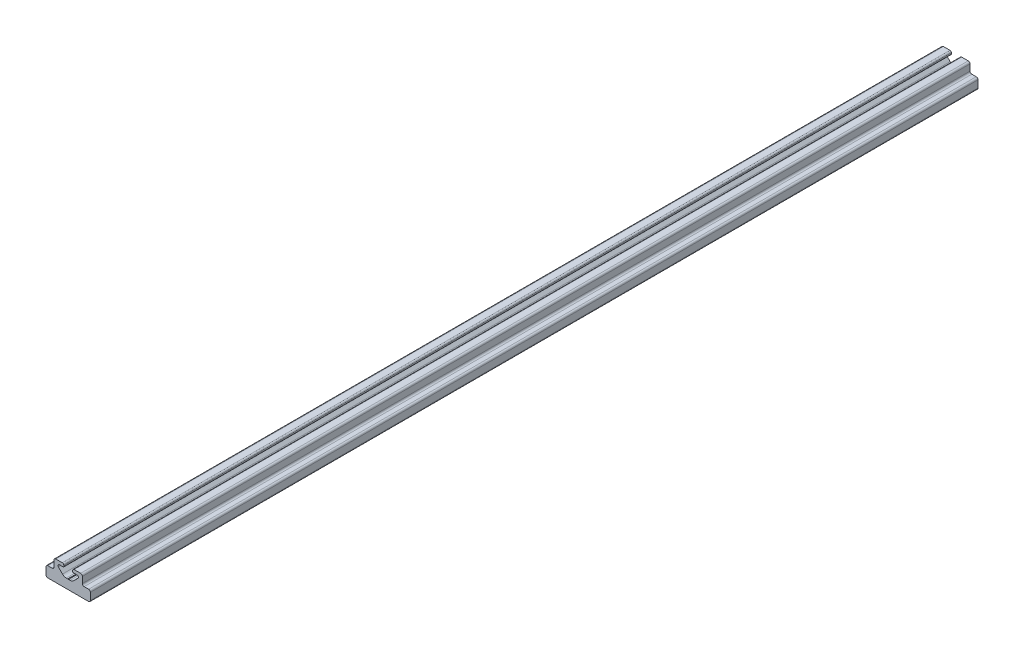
ISO-10303-21;
HEADER;
FILE_DESCRIPTION(('STEP AP214'),'2;1');
FILE_NAME('part.step','',(''),(''),'','','');
FILE_SCHEMA(('AUTOMOTIVE_DESIGN { 1 0 10303 214 1 1 1 1 }'));
ENDSEC;
DATA;
#1=APPLICATION_CONTEXT('core data for automotive mechanical design processes');
#2=APPLICATION_PROTOCOL_DEFINITION('international standard','automotive_design',2000,#1);
#3=PRODUCT_CONTEXT('',#1,'mechanical');
#4=PRODUCT('Part','Part','',(#3));
#5=PRODUCT_RELATED_PRODUCT_CATEGORY('part','',(#4));
#6=PRODUCT_DEFINITION_FORMATION('','',#4);
#7=PRODUCT_DEFINITION_CONTEXT('part definition',#1,'design');
#8=PRODUCT_DEFINITION('design','',#6,#7);
#9=PRODUCT_DEFINITION_SHAPE('','',#8);
#10=(LENGTH_UNIT() NAMED_UNIT(*) SI_UNIT(.MILLI.,.METRE.));
#11=(NAMED_UNIT(*) PLANE_ANGLE_UNIT() SI_UNIT($,.RADIAN.));
#12=(NAMED_UNIT(*) SI_UNIT($,.STERADIAN.) SOLID_ANGLE_UNIT());
#13=UNCERTAINTY_MEASURE_WITH_UNIT(LENGTH_MEASURE(1.E-05),#10,'distance_accuracy_value','');
#14=(GEOMETRIC_REPRESENTATION_CONTEXT(3) GLOBAL_UNCERTAINTY_ASSIGNED_CONTEXT((#13)) GLOBAL_UNIT_ASSIGNED_CONTEXT((#10,
#11,#12)) REPRESENTATION_CONTEXT('',''));
#15=CARTESIAN_POINT('',(0.,0.,0.));
#16=DIRECTION('',(0.,0.,1.));
#17=DIRECTION('',(1.,0.,0.));
#18=AXIS2_PLACEMENT_3D('',#15,#16,#17);
#19=CARTESIAN_POINT('',(0.,4.900028,0.));
#20=DIRECTION('',(0.707106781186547,-0.707106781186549,0.));
#21=DIRECTION('',(0.707106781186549,0.707106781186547,0.));
#22=AXIS2_PLACEMENT_3D('',#19,#20,#21);
#23=PLANE('',#22);
#24=DIRECTION('',(0.,0.,1.));
#25=VECTOR('',#24,1.);
#26=CARTESIAN_POINT('',(0.,4.900028,250.));
#27=LINE('',#26,#25);
#28=CARTESIAN_POINT('',(0.,4.900028,0.));
#29=VERTEX_POINT('',#28);
#30=CARTESIAN_POINT('',(0.,4.900028,500.));
#31=VERTEX_POINT('',#30);
#32=EDGE_CURVE('E384',#29,#31,#27,.T.);
#33=ORIENTED_EDGE('',*,*,#32,.T.);
#34=DIRECTION('',(-0.707106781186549,-0.707106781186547,0.));
#35=VECTOR('',#34,1.);
#36=CARTESIAN_POINT('',(0.125,5.025028,500.));
#37=LINE('',#36,#35);
#38=CARTESIAN_POINT('',(0.25,5.150028,500.));
#39=VERTEX_POINT('',#38);
#40=EDGE_CURVE('E230',#39,#31,#37,.T.);
#41=ORIENTED_EDGE('',*,*,#40,.F.);
#42=DIRECTION('',(0.,0.,-1.));
#43=VECTOR('',#42,1.);
#44=CARTESIAN_POINT('',(0.25,5.150028,250.));
#45=LINE('',#44,#43);
#46=CARTESIAN_POINT('',(0.25,5.150028,0.));
#47=VERTEX_POINT('',#46);
#48=EDGE_CURVE('E362',#39,#47,#45,.T.);
#49=ORIENTED_EDGE('',*,*,#48,.T.);
#50=DIRECTION('',(0.707106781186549,0.707106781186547,0.));
#51=VECTOR('',#50,1.);
#52=CARTESIAN_POINT('',(0.125,5.025028,0.));
#53=LINE('',#52,#51);
#54=EDGE_CURVE('E386',#29,#47,#53,.T.);
#55=ORIENTED_EDGE('',*,*,#54,.F.);
#56=EDGE_LOOP('',(#33,#41,#49,#55));
#57=FACE_BOUND('',#56,.T.);
#58=ADVANCED_FACE('F14',(#57),#23,.F.);
#59=CARTESIAN_POINT('',(-0.25,5.150028,0.));
#60=DIRECTION('',(-0.707106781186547,-0.707106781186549,0.));
#61=DIRECTION('',(0.707106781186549,-0.707106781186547,0.));
#62=AXIS2_PLACEMENT_3D('',#59,#60,#61);
#63=PLANE('',#62);
#64=DIRECTION('',(0.,0.,1.));
#65=VECTOR('',#64,1.);
#66=CARTESIAN_POINT('',(-0.25,5.150028,250.));
#67=LINE('',#66,#65);
#68=CARTESIAN_POINT('',(-0.25,5.150028,0.));
#69=VERTEX_POINT('',#68);
#70=CARTESIAN_POINT('',(-0.25,5.150028,500.));
#71=VERTEX_POINT('',#70);
#72=EDGE_CURVE('E356',#69,#71,#67,.T.);
#73=ORIENTED_EDGE('',*,*,#72,.T.);
#74=DIRECTION('',(-0.707106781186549,0.707106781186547,0.));
#75=VECTOR('',#74,1.);
#76=CARTESIAN_POINT('',(-0.125,5.025028,500.));
#77=LINE('',#76,#75);
#78=EDGE_CURVE('E381',#31,#71,#77,.T.);
#79=ORIENTED_EDGE('',*,*,#78,.F.);
#80=ORIENTED_EDGE('',*,*,#32,.F.);
#81=DIRECTION('',(0.707106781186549,-0.707106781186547,0.));
#82=VECTOR('',#81,1.);
#83=CARTESIAN_POINT('',(-0.125,5.025028,0.));
#84=LINE('',#83,#82);
#85=EDGE_CURVE('E374',#69,#29,#84,.T.);
#86=ORIENTED_EDGE('',*,*,#85,.F.);
#87=EDGE_LOOP('',(#73,#79,#80,#86));
#88=FACE_BOUND('',#87,.T.);
#89=ADVANCED_FACE('F622',(#88),#63,.F.);
#90=CARTESIAN_POINT('',(2.5,10.,0.));
#91=DIRECTION('',(-1.,0.,0.));
#92=DIRECTION('',(0.,0.,1.));
#93=AXIS2_PLACEMENT_3D('',#90,#91,#92);
#94=PLANE('',#93);
#95=DIRECTION('',(0.,1.,0.));
#96=VECTOR('',#95,1.);
#97=CARTESIAN_POINT('',(2.5,10.350014,500.));
#98=LINE('',#97,#96);
#99=CARTESIAN_POINT('',(2.5,9.99999999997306,500.));
#100=VERTEX_POINT('',#99);
#101=CARTESIAN_POINT('',(2.5,10.700028,500.));
#102=VERTEX_POINT('',#101);
#103=EDGE_CURVE('E221',#100,#102,#98,.T.);
#104=ORIENTED_EDGE('',*,*,#103,.T.);
#105=DIRECTION('',(0.,0.,1.));
#106=VECTOR('',#105,1.);
#107=CARTESIAN_POINT('',(2.5,10.700028,250.));
#108=LINE('',#107,#106);
#109=CARTESIAN_POINT('',(2.5,10.700028,0.));
#110=VERTEX_POINT('',#109);
#111=EDGE_CURVE('E367',#102,#110,#108,.F.);
#112=ORIENTED_EDGE('',*,*,#111,.T.);
#113=DIRECTION('',(0.,-1.,0.));
#114=VECTOR('',#113,1.);
#115=CARTESIAN_POINT('',(2.5,10.350014,0.));
#116=LINE('',#115,#114);
#117=CARTESIAN_POINT('',(2.5,9.99999999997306,0.));
#118=VERTEX_POINT('',#117);
#119=EDGE_CURVE('E372',#110,#118,#116,.T.);
#120=ORIENTED_EDGE('',*,*,#119,.T.);
#121=DIRECTION('',(0.,0.,-1.));
#122=VECTOR('',#121,1.);
#123=CARTESIAN_POINT('',(2.5,9.99999999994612,250.));
#124=LINE('',#123,#122);
#125=EDGE_CURVE('E376',#118,#100,#124,.F.);
#126=ORIENTED_EDGE('',*,*,#125,.T.);
#127=EDGE_LOOP('',(#104,#112,#120,#126));
#128=FACE_BOUND('',#127,.T.);
#129=ADVANCED_FACE('F547',(#128),#94,.T.);
#130=CARTESIAN_POINT('',(2.8,10.,500.));
#131=DIRECTION('',(0.,0.,-1.));
#132=DIRECTION('',(-1.,0.,0.));
#133=AXIS2_PLACEMENT_3D('',#130,#131,#132);
#134=CYLINDRICAL_SURFACE('',#133,0.3);
#135=DIRECTION('',(0.,0.,-1.));
#136=VECTOR('',#135,1.);
#137=CARTESIAN_POINT('',(2.8,9.7,250.));
#138=LINE('',#137,#136);
#139=CARTESIAN_POINT('',(2.8,9.6999999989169,500.));
#140=VERTEX_POINT('',#139);
#141=CARTESIAN_POINT('',(2.8,9.6999999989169,0.));
#142=VERTEX_POINT('',#141);
#143=EDGE_CURVE('E345',#140,#142,#138,.T.);
#144=ORIENTED_EDGE('',*,*,#143,.F.);
#145=CARTESIAN_POINT('',(2.8,10.,500.));
#146=DIRECTION('',(0.,0.,-1.));
#147=DIRECTION('',(-1.,0.,0.));
#148=AXIS2_PLACEMENT_3D('',#145,#146,#147);
#149=CIRCLE('',#148,0.3);
#150=EDGE_CURVE('E18',#100,#140,#149,.F.);
#151=ORIENTED_EDGE('',*,*,#150,.F.);
#152=ORIENTED_EDGE('',*,*,#125,.F.);
#153=CARTESIAN_POINT('',(2.8,10.,0.));
#154=DIRECTION('',(0.,0.,-1.));
#155=DIRECTION('',(-1.,0.,0.));
#156=AXIS2_PLACEMENT_3D('',#153,#154,#155);
#157=CIRCLE('',#156,0.3);
#158=EDGE_CURVE('E366',#142,#118,#157,.T.);
#159=ORIENTED_EDGE('',*,*,#158,.F.);
#160=EDGE_LOOP('',(#144,#151,#152,#159));
#161=FACE_BOUND('',#160,.T.);
#162=ADVANCED_FACE('F467',(#161),#134,.T.);
#163=CARTESIAN_POINT('',(0.25,5.150028,0.));
#164=DIRECTION('',(0.,-1.,0.));
#165=DIRECTION('',(1.,0.,0.));
#166=AXIS2_PLACEMENT_3D('',#163,#164,#165);
#167=PLANE('',#166);
#168=ORIENTED_EDGE('',*,*,#48,.F.);
#169=DIRECTION('',(-1.,0.,0.));
#170=VECTOR('',#169,1.);
#171=CARTESIAN_POINT('',(0.6693790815,5.150028,500.));
#172=LINE('',#171,#170);
#173=CARTESIAN_POINT('',(1.08875816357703,5.150028,500.));
#174=VERTEX_POINT('',#173);
#175=EDGE_CURVE('E363',#174,#39,#172,.T.);
#176=ORIENTED_EDGE('',*,*,#175,.F.);
#177=DIRECTION('',(0.,0.,-1.));
#178=VECTOR('',#177,1.);
#179=CARTESIAN_POINT('',(1.08875816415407,5.150028,250.));
#180=LINE('',#179,#178);
#181=CARTESIAN_POINT('',(1.08875816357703,5.150028,0.));
#182=VERTEX_POINT('',#181);
#183=EDGE_CURVE('E337',#182,#174,#180,.F.);
#184=ORIENTED_EDGE('',*,*,#183,.F.);
#185=DIRECTION('',(1.,0.,0.));
#186=VECTOR('',#185,1.);
#187=CARTESIAN_POINT('',(0.6693790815,5.150028,0.));
#188=LINE('',#187,#186);
#189=EDGE_CURVE('E360',#47,#182,#188,.T.);
#190=ORIENTED_EDGE('',*,*,#189,.F.);
#191=EDGE_LOOP('',(#168,#176,#184,#190));
#192=FACE_BOUND('',#191,.T.);
#193=ADVANCED_FACE('F628',(#192),#167,.F.);
#194=CARTESIAN_POINT('',(-1.088758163,5.150028,0.));
#195=DIRECTION('',(0.,-1.,0.));
#196=DIRECTION('',(1.,0.,0.));
#197=AXIS2_PLACEMENT_3D('',#194,#195,#196);
#198=PLANE('',#197);
#199=DIRECTION('',(0.,0.,1.));
#200=VECTOR('',#199,1.);
#201=CARTESIAN_POINT('',(-1.08875816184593,5.150028,250.));
#202=LINE('',#201,#200);
#203=CARTESIAN_POINT('',(-1.08875816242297,5.150028,500.));
#204=VERTEX_POINT('',#203);
#205=CARTESIAN_POINT('',(-1.08875816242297,5.150028,0.));
#206=VERTEX_POINT('',#205);
#207=EDGE_CURVE('E326',#204,#206,#202,.F.);
#208=ORIENTED_EDGE('',*,*,#207,.F.);
#209=DIRECTION('',(-1.,0.,0.));
#210=VECTOR('',#209,1.);
#211=CARTESIAN_POINT('',(-0.6693790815,5.150028,500.));
#212=LINE('',#211,#210);
#213=EDGE_CURVE('E353',#71,#204,#212,.T.);
#214=ORIENTED_EDGE('',*,*,#213,.F.);
#215=ORIENTED_EDGE('',*,*,#72,.F.);
#216=DIRECTION('',(1.,0.,0.));
#217=VECTOR('',#216,1.);
#218=CARTESIAN_POINT('',(-0.6693790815,5.150028,0.));
#219=LINE('',#218,#217);
#220=EDGE_CURVE('E355',#206,#69,#219,.T.);
#221=ORIENTED_EDGE('',*,*,#220,.F.);
#222=EDGE_LOOP('',(#208,#214,#215,#221));
#223=FACE_BOUND('',#222,.T.);
#224=ADVANCED_FACE('F631',(#223),#198,.F.);
#225=CARTESIAN_POINT('',(-3.3,10.700028,500.));
#226=DIRECTION('',(0.,0.,-1.));
#227=DIRECTION('',(-1.,0.,0.));
#228=AXIS2_PLACEMENT_3D('',#225,#226,#227);
#229=CYLINDRICAL_SURFACE('',#228,0.8);
#230=DIRECTION('',(0.,0.,-1.));
#231=VECTOR('',#230,1.);
#232=CARTESIAN_POINT('',(-3.3,11.500028,250.));
#233=LINE('',#232,#231);
#234=CARTESIAN_POINT('',(-3.3,11.500028,500.));
#235=VERTEX_POINT('',#234);
#236=CARTESIAN_POINT('',(-3.3,11.500028,0.));
#237=VERTEX_POINT('',#236);
#238=EDGE_CURVE('E323',#235,#237,#233,.T.);
#239=ORIENTED_EDGE('',*,*,#238,.F.);
#240=CARTESIAN_POINT('',(-3.3,10.700028,500.));
#241=DIRECTION('',(0.,0.,-1.));
#242=DIRECTION('',(-1.,0.,0.));
#243=AXIS2_PLACEMENT_3D('',#240,#241,#242);
#244=CIRCLE('',#243,0.8);
#245=CARTESIAN_POINT('',(-2.5,10.700028,500.));
#246=VERTEX_POINT('',#245);
#247=EDGE_CURVE('E359',#246,#235,#244,.F.);
#248=ORIENTED_EDGE('',*,*,#247,.F.);
#249=DIRECTION('',(0.,0.,-1.));
#250=VECTOR('',#249,1.);
#251=CARTESIAN_POINT('',(-2.5,10.700028,250.));
#252=LINE('',#251,#250);
#253=CARTESIAN_POINT('',(-2.5,10.700028,0.));
#254=VERTEX_POINT('',#253);
#255=EDGE_CURVE('E349',#246,#254,#252,.T.);
#256=ORIENTED_EDGE('',*,*,#255,.T.);
#257=CARTESIAN_POINT('',(-3.3,10.700028,0.));
#258=DIRECTION('',(0.,0.,-1.));
#259=DIRECTION('',(-1.,0.,0.));
#260=AXIS2_PLACEMENT_3D('',#257,#258,#259);
#261=CIRCLE('',#260,0.8);
#262=EDGE_CURVE('E457',#237,#254,#261,.T.);
#263=ORIENTED_EDGE('',*,*,#262,.F.);
#264=EDGE_LOOP('',(#239,#248,#256,#263));
#265=FACE_BOUND('',#264,.T.);
#266=ADVANCED_FACE('F635',(#265),#229,.T.);
#267=CARTESIAN_POINT('',(-7.,10.500028,500.));
#268=DIRECTION('',(0.,0.,-1.));
#269=DIRECTION('',(-1.,0.,0.));
#270=AXIS2_PLACEMENT_3D('',#267,#268,#269);
#271=CYLINDRICAL_SURFACE('',#270,1.);
#272=DIRECTION('',(0.,0.,-1.));
#273=VECTOR('',#272,1.);
#274=CARTESIAN_POINT('',(-8.,10.500028,250.));
#275=LINE('',#274,#273);
#276=CARTESIAN_POINT('',(-8.,10.500028,500.));
#277=VERTEX_POINT('',#276);
#278=CARTESIAN_POINT('',(-8.,10.500028,0.));
#279=VERTEX_POINT('',#278);
#280=EDGE_CURVE('E316',#277,#279,#275,.T.);
#281=ORIENTED_EDGE('',*,*,#280,.F.);
#282=CARTESIAN_POINT('',(-7.,10.500028,500.));
#283=DIRECTION('',(0.,0.,-1.));
#284=DIRECTION('',(-1.,0.,0.));
#285=AXIS2_PLACEMENT_3D('',#282,#283,#284);
#286=CIRCLE('',#285,1.);
#287=CARTESIAN_POINT('',(-7.,11.500028,500.));
#288=VERTEX_POINT('',#287);
#289=EDGE_CURVE('E455',#288,#277,#286,.F.);
#290=ORIENTED_EDGE('',*,*,#289,.F.);
#291=DIRECTION('',(0.,0.,1.));
#292=VECTOR('',#291,1.);
#293=CARTESIAN_POINT('',(-7.,11.500028,250.));
#294=LINE('',#293,#292);
#295=CARTESIAN_POINT('',(-7.,11.500028,0.));
#296=VERTEX_POINT('',#295);
#297=EDGE_CURVE('E322',#296,#288,#294,.T.);
#298=ORIENTED_EDGE('',*,*,#297,.F.);
#299=CARTESIAN_POINT('',(-7.,10.500028,0.));
#300=DIRECTION('',(0.,0.,-1.));
#301=DIRECTION('',(-1.,0.,0.));
#302=AXIS2_PLACEMENT_3D('',#299,#300,#301);
#303=CIRCLE('',#302,1.);
#304=EDGE_CURVE('E453',#279,#296,#303,.T.);
#305=ORIENTED_EDGE('',*,*,#304,.F.);
#306=EDGE_LOOP('',(#281,#290,#298,#305));
#307=FACE_BOUND('',#306,.T.);
#308=ADVANCED_FACE('F509',(#307),#271,.T.);
#309=CARTESIAN_POINT('',(-9.,7.,500.));
#310=DIRECTION('',(0.,0.,-1.));
#311=DIRECTION('',(-1.,0.,0.));
#312=AXIS2_PLACEMENT_3D('',#309,#310,#311);
#313=CYLINDRICAL_SURFACE('',#312,1.);
#314=CARTESIAN_POINT('',(-9.,7.,500.));
#315=DIRECTION('',(0.,0.,-1.));
#316=DIRECTION('',(-1.,0.,0.));
#317=AXIS2_PLACEMENT_3D('',#314,#315,#316);
#318=CIRCLE('',#317,1.);
#319=CARTESIAN_POINT('',(-9.,5.99999999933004,500.));
#320=VERTEX_POINT('',#319);
#321=CARTESIAN_POINT('',(-8.,7.,500.));
#322=VERTEX_POINT('',#321);
#323=EDGE_CURVE('E449',#320,#322,#318,.F.);
#324=ORIENTED_EDGE('',*,*,#323,.T.);
#325=DIRECTION('',(0.,0.,1.));
#326=VECTOR('',#325,1.);
#327=CARTESIAN_POINT('',(-8.,7.,250.));
#328=LINE('',#327,#326);
#329=CARTESIAN_POINT('',(-8.,7.,0.));
#330=VERTEX_POINT('',#329);
#331=EDGE_CURVE('E319',#330,#322,#328,.T.);
#332=ORIENTED_EDGE('',*,*,#331,.F.);
#333=CARTESIAN_POINT('',(-9.,7.,0.));
#334=DIRECTION('',(0.,0.,-1.));
#335=DIRECTION('',(-1.,0.,0.));
#336=AXIS2_PLACEMENT_3D('',#333,#334,#335);
#337=CIRCLE('',#336,1.);
#338=CARTESIAN_POINT('',(-9.,5.99999999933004,0.));
#339=VERTEX_POINT('',#338);
#340=EDGE_CURVE('E451',#330,#339,#337,.T.);
#341=ORIENTED_EDGE('',*,*,#340,.T.);
#342=DIRECTION('',(0.,0.,-1.));
#343=VECTOR('',#342,1.);
#344=CARTESIAN_POINT('',(-9.,6.,250.));
#345=LINE('',#344,#343);
#346=EDGE_CURVE('E310',#320,#339,#345,.T.);
#347=ORIENTED_EDGE('',*,*,#346,.F.);
#348=EDGE_LOOP('',(#324,#332,#341,#347));
#349=FACE_BOUND('',#348,.T.);
#350=ADVANCED_FACE('F598',(#349),#313,.F.);
#351=CARTESIAN_POINT('',(-11.5,5.,500.));
#352=DIRECTION('',(0.,0.,-1.));
#353=DIRECTION('',(-1.,0.,0.));
#354=AXIS2_PLACEMENT_3D('',#351,#352,#353);
#355=CYLINDRICAL_SURFACE('',#354,1.);
#356=DIRECTION('',(0.,0.,-1.));
#357=VECTOR('',#356,1.);
#358=CARTESIAN_POINT('',(-12.5,5.,250.));
#359=LINE('',#358,#357);
#360=CARTESIAN_POINT('',(-12.5,5.,500.));
#361=VERTEX_POINT('',#360);
#362=CARTESIAN_POINT('',(-12.5,5.,0.));
#363=VERTEX_POINT('',#362);
#364=EDGE_CURVE('E302',#361,#363,#359,.T.);
#365=ORIENTED_EDGE('',*,*,#364,.F.);
#366=CARTESIAN_POINT('',(-11.5,5.,500.));
#367=DIRECTION('',(0.,0.,-1.));
#368=DIRECTION('',(-1.,0.,0.));
#369=AXIS2_PLACEMENT_3D('',#366,#367,#368);
#370=CIRCLE('',#369,1.);
#371=CARTESIAN_POINT('',(-11.5,5.99999999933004,500.));
#372=VERTEX_POINT('',#371);
#373=EDGE_CURVE('E447',#372,#361,#370,.F.);
#374=ORIENTED_EDGE('',*,*,#373,.F.);
#375=DIRECTION('',(0.,0.,1.));
#376=VECTOR('',#375,1.);
#377=CARTESIAN_POINT('',(-11.5,6.,250.));
#378=LINE('',#377,#376);
#379=CARTESIAN_POINT('',(-11.5,5.99999999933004,0.));
#380=VERTEX_POINT('',#379);
#381=EDGE_CURVE('E313',#380,#372,#378,.T.);
#382=ORIENTED_EDGE('',*,*,#381,.F.);
#383=CARTESIAN_POINT('',(-11.5,5.,0.));
#384=DIRECTION('',(0.,0.,-1.));
#385=DIRECTION('',(-1.,0.,0.));
#386=AXIS2_PLACEMENT_3D('',#383,#384,#385);
#387=CIRCLE('',#386,1.);
#388=EDGE_CURVE('E445',#363,#380,#387,.T.);
#389=ORIENTED_EDGE('',*,*,#388,.F.);
#390=EDGE_LOOP('',(#365,#374,#382,#389));
#391=FACE_BOUND('',#390,.T.);
#392=ADVANCED_FACE('F591',(#391),#355,.T.);
#393=CARTESIAN_POINT('',(-11.5,1.,500.));
#394=DIRECTION('',(0.,0.,-1.));
#395=DIRECTION('',(-1.,0.,0.));
#396=AXIS2_PLACEMENT_3D('',#393,#394,#395);
#397=CYLINDRICAL_SURFACE('',#396,1.);
#398=DIRECTION('',(0.,0.,1.));
#399=VECTOR('',#398,1.);
#400=CARTESIAN_POINT('',(-11.5,0.,250.));
#401=LINE('',#400,#399);
#402=CARTESIAN_POINT('',(-11.5,0.,0.));
#403=VERTEX_POINT('',#402);
#404=CARTESIAN_POINT('',(-11.5,0.,500.));
#405=VERTEX_POINT('',#404);
#406=EDGE_CURVE('E299',#403,#405,#401,.T.);
#407=ORIENTED_EDGE('',*,*,#406,.T.);
#408=CARTESIAN_POINT('',(-11.5,1.,500.));
#409=DIRECTION('',(0.,0.,-1.));
#410=DIRECTION('',(-1.,0.,0.));
#411=AXIS2_PLACEMENT_3D('',#408,#409,#410);
#412=CIRCLE('',#411,1.);
#413=CARTESIAN_POINT('',(-12.5,1.,500.));
#414=VERTEX_POINT('',#413);
#415=EDGE_CURVE('E443',#414,#405,#412,.F.);
#416=ORIENTED_EDGE('',*,*,#415,.F.);
#417=DIRECTION('',(0.,0.,1.));
#418=VECTOR('',#417,1.);
#419=CARTESIAN_POINT('',(-12.5,1.,250.));
#420=LINE('',#419,#418);
#421=CARTESIAN_POINT('',(-12.5,1.,0.));
#422=VERTEX_POINT('',#421);
#423=EDGE_CURVE('E307',#422,#414,#420,.T.);
#424=ORIENTED_EDGE('',*,*,#423,.F.);
#425=CARTESIAN_POINT('',(-11.5,1.,0.));
#426=DIRECTION('',(0.,0.,-1.));
#427=DIRECTION('',(-1.,0.,0.));
#428=AXIS2_PLACEMENT_3D('',#425,#426,#427);
#429=CIRCLE('',#428,1.);
#430=EDGE_CURVE('E441',#403,#422,#429,.T.);
#431=ORIENTED_EDGE('',*,*,#430,.F.);
#432=EDGE_LOOP('',(#407,#416,#424,#431));
#433=FACE_BOUND('',#432,.T.);
#434=ADVANCED_FACE('F581',(#433),#397,.T.);
#435=CARTESIAN_POINT('',(11.5,1.,500.));
#436=DIRECTION('',(0.,0.,-1.));
#437=DIRECTION('',(-1.,0.,0.));
#438=AXIS2_PLACEMENT_3D('',#435,#436,#437);
#439=CYLINDRICAL_SURFACE('',#438,1.);
#440=DIRECTION('',(0.,0.,1.));
#441=VECTOR('',#440,1.);
#442=CARTESIAN_POINT('',(12.5,1.,250.));
#443=LINE('',#442,#441);
#444=CARTESIAN_POINT('',(12.5,1.,0.));
#445=VERTEX_POINT('',#444);
#446=CARTESIAN_POINT('',(12.5,1.,500.));
#447=VERTEX_POINT('',#446);
#448=EDGE_CURVE('E293',#445,#447,#443,.T.);
#449=ORIENTED_EDGE('',*,*,#448,.T.);
#450=CARTESIAN_POINT('',(11.5,1.,500.));
#451=DIRECTION('',(0.,0.,-1.));
#452=DIRECTION('',(-1.,0.,0.));
#453=AXIS2_PLACEMENT_3D('',#450,#451,#452);
#454=CIRCLE('',#453,1.);
#455=CARTESIAN_POINT('',(11.5,0.,500.));
#456=VERTEX_POINT('',#455);
#457=EDGE_CURVE('E439',#456,#447,#454,.F.);
#458=ORIENTED_EDGE('',*,*,#457,.F.);
#459=DIRECTION('',(0.,0.,-1.));
#460=VECTOR('',#459,1.);
#461=CARTESIAN_POINT('',(11.5,0.,250.));
#462=LINE('',#461,#460);
#463=CARTESIAN_POINT('',(11.5,0.,0.));
#464=VERTEX_POINT('',#463);
#465=EDGE_CURVE('E296',#456,#464,#462,.T.);
#466=ORIENTED_EDGE('',*,*,#465,.T.);
#467=CARTESIAN_POINT('',(11.5,1.,0.));
#468=DIRECTION('',(0.,0.,-1.));
#469=DIRECTION('',(-1.,0.,0.));
#470=AXIS2_PLACEMENT_3D('',#467,#468,#469);
#471=CIRCLE('',#470,1.);
#472=EDGE_CURVE('E437',#445,#464,#471,.T.);
#473=ORIENTED_EDGE('',*,*,#472,.F.);
#474=EDGE_LOOP('',(#449,#458,#466,#473));
#475=FACE_BOUND('',#474,.T.);
#476=ADVANCED_FACE('F575',(#475),#439,.T.);
#477=CARTESIAN_POINT('',(11.5,5.,500.));
#478=DIRECTION('',(0.,0.,-1.));
#479=DIRECTION('',(-1.,0.,0.));
#480=AXIS2_PLACEMENT_3D('',#477,#478,#479);
#481=CYLINDRICAL_SURFACE('',#480,1.);
#482=DIRECTION('',(0.,0.,-1.));
#483=VECTOR('',#482,1.);
#484=CARTESIAN_POINT('',(11.5,6.,250.));
#485=LINE('',#484,#483);
#486=CARTESIAN_POINT('',(11.5,5.99999999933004,500.));
#487=VERTEX_POINT('',#486);
#488=CARTESIAN_POINT('',(11.5,5.99999999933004,0.));
#489=VERTEX_POINT('',#488);
#490=EDGE_CURVE('E284',#487,#489,#485,.T.);
#491=ORIENTED_EDGE('',*,*,#490,.F.);
#492=CARTESIAN_POINT('',(11.5,5.,500.));
#493=DIRECTION('',(0.,0.,-1.));
#494=DIRECTION('',(-1.,0.,0.));
#495=AXIS2_PLACEMENT_3D('',#492,#493,#494);
#496=CIRCLE('',#495,1.);
#497=CARTESIAN_POINT('',(12.5,5.,500.));
#498=VERTEX_POINT('',#497);
#499=EDGE_CURVE('E435',#498,#487,#496,.F.);
#500=ORIENTED_EDGE('',*,*,#499,.F.);
#501=DIRECTION('',(0.,0.,-1.));
#502=VECTOR('',#501,1.);
#503=CARTESIAN_POINT('',(12.5,5.,250.));
#504=LINE('',#503,#502);
#505=CARTESIAN_POINT('',(12.5,5.,0.));
#506=VERTEX_POINT('',#505);
#507=EDGE_CURVE('E292',#498,#506,#504,.T.);
#508=ORIENTED_EDGE('',*,*,#507,.T.);
#509=CARTESIAN_POINT('',(11.5,5.,0.));
#510=DIRECTION('',(0.,0.,-1.));
#511=DIRECTION('',(-1.,0.,0.));
#512=AXIS2_PLACEMENT_3D('',#509,#510,#511);
#513=CIRCLE('',#512,1.);
#514=EDGE_CURVE('E433',#489,#506,#513,.T.);
#515=ORIENTED_EDGE('',*,*,#514,.F.);
#516=EDGE_LOOP('',(#491,#500,#508,#515));
#517=FACE_BOUND('',#516,.T.);
#518=ADVANCED_FACE('F566',(#517),#481,.T.);
#519=CARTESIAN_POINT('',(9.,7.,500.));
#520=DIRECTION('',(0.,0.,-1.));
#521=DIRECTION('',(-1.,0.,0.));
#522=AXIS2_PLACEMENT_3D('',#519,#520,#521);
#523=CYLINDRICAL_SURFACE('',#522,1.);
#524=CARTESIAN_POINT('',(9.,7.,500.));
#525=DIRECTION('',(0.,0.,-1.));
#526=DIRECTION('',(-1.,0.,0.));
#527=AXIS2_PLACEMENT_3D('',#524,#525,#526);
#528=CIRCLE('',#527,1.);
#529=CARTESIAN_POINT('',(8.,7.,500.));
#530=VERTEX_POINT('',#529);
#531=CARTESIAN_POINT('',(9.,5.99999999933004,500.));
#532=VERTEX_POINT('',#531);
#533=EDGE_CURVE('E429',#530,#532,#528,.F.);
#534=ORIENTED_EDGE('',*,*,#533,.T.);
#535=DIRECTION('',(0.,0.,1.));
#536=VECTOR('',#535,1.);
#537=CARTESIAN_POINT('',(9.,6.,250.));
#538=LINE('',#537,#536);
#539=CARTESIAN_POINT('',(9.,5.99999999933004,0.));
#540=VERTEX_POINT('',#539);
#541=EDGE_CURVE('E289',#540,#532,#538,.T.);
#542=ORIENTED_EDGE('',*,*,#541,.F.);
#543=CARTESIAN_POINT('',(9.,7.,0.));
#544=DIRECTION('',(0.,0.,-1.));
#545=DIRECTION('',(-1.,0.,0.));
#546=AXIS2_PLACEMENT_3D('',#543,#544,#545);
#547=CIRCLE('',#546,1.);
#548=CARTESIAN_POINT('',(8.,7.,0.));
#549=VERTEX_POINT('',#548);
#550=EDGE_CURVE('E431',#540,#549,#547,.T.);
#551=ORIENTED_EDGE('',*,*,#550,.T.);
#552=DIRECTION('',(0.,0.,1.));
#553=VECTOR('',#552,1.);
#554=CARTESIAN_POINT('',(8.,7.,250.));
#555=LINE('',#554,#553);
#556=EDGE_CURVE('E281',#549,#530,#555,.T.);
#557=ORIENTED_EDGE('',*,*,#556,.T.);
#558=EDGE_LOOP('',(#534,#542,#551,#557));
#559=FACE_BOUND('',#558,.T.);
#560=ADVANCED_FACE('F557',(#559),#523,.F.);
#561=CARTESIAN_POINT('',(3.3,10.700028,500.));
#562=DIRECTION('',(0.,0.,-1.));
#563=DIRECTION('',(-1.,0.,0.));
#564=AXIS2_PLACEMENT_3D('',#561,#562,#563);
#565=CYLINDRICAL_SURFACE('',#564,0.8);
#566=ORIENTED_EDGE('',*,*,#111,.F.);
#567=CARTESIAN_POINT('',(3.3,10.700028,500.));
#568=DIRECTION('',(0.,0.,-1.));
#569=DIRECTION('',(-1.,0.,0.));
#570=AXIS2_PLACEMENT_3D('',#567,#568,#569);
#571=CIRCLE('',#570,0.8);
#572=CARTESIAN_POINT('',(3.300000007,11.500028,500.));
#573=VERTEX_POINT('',#572);
#574=EDGE_CURVE('E371',#573,#102,#571,.F.);
#575=ORIENTED_EDGE('',*,*,#574,.F.);
#576=DIRECTION('',(0.,0.,1.));
#577=VECTOR('',#576,1.);
#578=CARTESIAN_POINT('',(3.300000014,11.500028,250.));
#579=LINE('',#578,#577);
#580=CARTESIAN_POINT('',(3.300000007,11.500028,0.));
#581=VERTEX_POINT('',#580);
#582=EDGE_CURVE('E277',#581,#573,#579,.T.);
#583=ORIENTED_EDGE('',*,*,#582,.F.);
#584=CARTESIAN_POINT('',(3.3,10.700028,0.));
#585=DIRECTION('',(0.,0.,-1.));
#586=DIRECTION('',(-1.,0.,0.));
#587=AXIS2_PLACEMENT_3D('',#584,#585,#586);
#588=CIRCLE('',#587,0.8);
#589=EDGE_CURVE('E370',#110,#581,#588,.T.);
#590=ORIENTED_EDGE('',*,*,#589,.F.);
#591=EDGE_LOOP('',(#566,#575,#583,#590));
#592=FACE_BOUND('',#591,.T.);
#593=ADVANCED_FACE('F545',(#592),#565,.T.);
#594=CARTESIAN_POINT('',(7.,10.500028,500.));
#595=DIRECTION('',(0.,0.,-1.));
#596=DIRECTION('',(-1.,0.,0.));
#597=AXIS2_PLACEMENT_3D('',#594,#595,#596);
#598=CYLINDRICAL_SURFACE('',#597,1.);
#599=DIRECTION('',(0.,0.,-1.));
#600=VECTOR('',#599,1.);
#601=CARTESIAN_POINT('',(7.,11.500028,250.));
#602=LINE('',#601,#600);
#603=CARTESIAN_POINT('',(7.,11.500028,500.));
#604=VERTEX_POINT('',#603);
#605=CARTESIAN_POINT('',(7.,11.500028,0.));
#606=VERTEX_POINT('',#605);
#607=EDGE_CURVE('E273',#604,#606,#602,.T.);
#608=ORIENTED_EDGE('',*,*,#607,.F.);
#609=CARTESIAN_POINT('',(7.,10.500028,500.));
#610=DIRECTION('',(0.,0.,-1.));
#611=DIRECTION('',(-1.,0.,0.));
#612=AXIS2_PLACEMENT_3D('',#609,#610,#611);
#613=CIRCLE('',#612,1.);
#614=CARTESIAN_POINT('',(8.,10.500028,500.));
#615=VERTEX_POINT('',#614);
#616=EDGE_CURVE('E425',#615,#604,#613,.F.);
#617=ORIENTED_EDGE('',*,*,#616,.F.);
#618=DIRECTION('',(0.,0.,-1.));
#619=VECTOR('',#618,1.);
#620=CARTESIAN_POINT('',(8.,10.500028,250.));
#621=LINE('',#620,#619);
#622=CARTESIAN_POINT('',(8.,10.500028,0.));
#623=VERTEX_POINT('',#622);
#624=EDGE_CURVE('E280',#615,#623,#621,.T.);
#625=ORIENTED_EDGE('',*,*,#624,.T.);
#626=CARTESIAN_POINT('',(7.,10.500028,0.));
#627=DIRECTION('',(0.,0.,-1.));
#628=DIRECTION('',(-1.,0.,0.));
#629=AXIS2_PLACEMENT_3D('',#626,#627,#628);
#630=CIRCLE('',#629,1.);
#631=EDGE_CURVE('E352',#606,#623,#630,.T.);
#632=ORIENTED_EDGE('',*,*,#631,.F.);
#633=EDGE_LOOP('',(#608,#617,#625,#632));
#634=FACE_BOUND('',#633,.T.);
#635=ADVANCED_FACE('F551',(#634),#598,.T.);
#636=CARTESIAN_POINT('',(-2.5,10.700028,0.));
#637=DIRECTION('',(-1.,0.,0.));
#638=DIRECTION('',(0.,-1.,0.));
#639=AXIS2_PLACEMENT_3D('',#636,#637,#638);
#640=PLANE('',#639);
#641=ORIENTED_EDGE('',*,*,#255,.F.);
#642=DIRECTION('',(0.,1.,0.));
#643=VECTOR('',#642,1.);
#644=CARTESIAN_POINT('',(-2.5,5.750014,500.));
#645=LINE('',#644,#643);
#646=CARTESIAN_POINT('',(-2.5,9.99999999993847,500.));
#647=VERTEX_POINT('',#646);
#648=EDGE_CURVE('E414',#647,#246,#645,.T.);
#649=ORIENTED_EDGE('',*,*,#648,.F.);
#650=DIRECTION('',(0.,0.,1.));
#651=VECTOR('',#650,1.);
#652=CARTESIAN_POINT('',(-2.5,9.99999999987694,250.));
#653=LINE('',#652,#651);
#654=CARTESIAN_POINT('',(-2.5,9.99999999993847,0.));
#655=VERTEX_POINT('',#654);
#656=EDGE_CURVE('E329',#647,#655,#653,.F.);
#657=ORIENTED_EDGE('',*,*,#656,.T.);
#658=DIRECTION('',(0.,-1.,0.));
#659=VECTOR('',#658,1.);
#660=CARTESIAN_POINT('',(-2.5,10.350014,0.));
#661=LINE('',#660,#659);
#662=EDGE_CURVE('E246',#254,#655,#661,.T.);
#663=ORIENTED_EDGE('',*,*,#662,.F.);
#664=EDGE_LOOP('',(#641,#649,#657,#663));
#665=FACE_BOUND('',#664,.T.);
#666=ADVANCED_FACE('F637',(#665),#640,.F.);
#667=CARTESIAN_POINT('',(2.8,9.7,0.));
#668=DIRECTION('',(0.,-1.,0.));
#669=DIRECTION('',(1.,0.,0.));
#670=AXIS2_PLACEMENT_3D('',#667,#668,#669);
#671=PLANE('',#670);
#672=DIRECTION('',(1.,0.,0.));
#673=VECTOR('',#672,1.);
#674=CARTESIAN_POINT('',(0.,9.6999999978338,500.));
#675=LINE('',#674,#673);
#676=CARTESIAN_POINT('',(4.95000000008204,9.6999999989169,500.));
#677=VERTEX_POINT('',#676);
#678=EDGE_CURVE('E332',#140,#677,#675,.T.);
#679=ORIENTED_EDGE('',*,*,#678,.F.);
#680=ORIENTED_EDGE('',*,*,#143,.T.);
#681=DIRECTION('',(1.,0.,0.));
#682=VECTOR('',#681,1.);
#683=CARTESIAN_POINT('',(0.,9.6999999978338,0.));
#684=LINE('',#683,#682);
#685=CARTESIAN_POINT('',(4.95000000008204,9.6999999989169,0.));
#686=VERTEX_POINT('',#685);
#687=EDGE_CURVE('E267',#142,#686,#684,.T.);
#688=ORIENTED_EDGE('',*,*,#687,.T.);
#689=DIRECTION('',(0.,0.,1.));
#690=VECTOR('',#689,1.);
#691=CARTESIAN_POINT('',(4.95000000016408,9.7,250.));
#692=LINE('',#691,#690);
#693=EDGE_CURVE('E343',#677,#686,#692,.F.);
#694=ORIENTED_EDGE('',*,*,#693,.F.);
#695=EDGE_LOOP('',(#679,#680,#688,#694));
#696=FACE_BOUND('',#695,.T.);
#697=ADVANCED_FACE('F470',(#696),#671,.T.);
#698=CARTESIAN_POINT('',(4.95,8.9,500.));
#699=DIRECTION('',(0.,0.,-1.));
#700=DIRECTION('',(-1.,0.,0.));
#701=AXIS2_PLACEMENT_3D('',#698,#699,#700);
#702=CYLINDRICAL_SURFACE('',#701,0.8);
#703=CARTESIAN_POINT('',(4.95,8.9,500.));
#704=DIRECTION('',(0.,0.,-1.));
#705=DIRECTION('',(-1.,0.,0.));
#706=AXIS2_PLACEMENT_3D('',#703,#704,#705);
#707=CIRCLE('',#706,0.8);
#708=CARTESIAN_POINT('',(5.51568542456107,8.33431457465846,500.));
#709=VERTEX_POINT('',#708);
#710=EDGE_CURVE('E422',#677,#709,#707,.T.);
#711=ORIENTED_EDGE('',*,*,#710,.F.);
#712=ORIENTED_EDGE('',*,*,#693,.T.);
#713=CARTESIAN_POINT('',(4.95,8.9,0.));
#714=DIRECTION('',(0.,0.,-1.));
#715=DIRECTION('',(-1.,0.,0.));
#716=AXIS2_PLACEMENT_3D('',#713,#714,#715);
#717=CIRCLE('',#716,0.8);
#718=CARTESIAN_POINT('',(5.515685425,8.334314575,0.));
#719=VERTEX_POINT('',#718);
#720=EDGE_CURVE('E407',#686,#719,#717,.T.);
#721=ORIENTED_EDGE('',*,*,#720,.T.);
#722=DIRECTION('',(0.,0.,1.));
#723=VECTOR('',#722,1.);
#724=CARTESIAN_POINT('',(5.515685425,8.334314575,250.));
#725=LINE('',#724,#723);
#726=EDGE_CURVE('E340',#719,#709,#725,.T.);
#727=ORIENTED_EDGE('',*,*,#726,.T.);
#728=EDGE_LOOP('',(#711,#712,#721,#727));
#729=FACE_BOUND('',#728,.T.);
#730=ADVANCED_FACE('F643',(#729),#702,.F.);
#731=CARTESIAN_POINT('',(3.210078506,6.028707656,0.));
#732=DIRECTION('',(0.707106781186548,-0.707106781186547,0.));
#733=DIRECTION('',(0.707106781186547,0.707106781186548,0.));
#734=AXIS2_PLACEMENT_3D('',#731,#732,#733);
#735=PLANE('',#734);
#736=DIRECTION('',(0.,0.,1.));
#737=VECTOR('',#736,1.);
#738=CARTESIAN_POINT('',(3.21007850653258,6.02870765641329,250.));
#739=LINE('',#738,#737);
#740=CARTESIAN_POINT('',(3.2100785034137,6.02870765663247,500.));
#741=VERTEX_POINT('',#740);
#742=CARTESIAN_POINT('',(3.21007850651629,6.02870765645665,0.));
#743=VERTEX_POINT('',#742);
#744=EDGE_CURVE('E335',#741,#743,#739,.F.);
#745=ORIENTED_EDGE('',*,*,#744,.F.);
#746=DIRECTION('',(-0.707106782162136,-0.707106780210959,0.));
#747=VECTOR('',#746,1.);
#748=CARTESIAN_POINT('',(5.51568542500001,8.33431457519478,500.));
#749=LINE('',#748,#747);
#750=EDGE_CURVE('E420',#709,#741,#749,.T.);
#751=ORIENTED_EDGE('',*,*,#750,.F.);
#752=ORIENTED_EDGE('',*,*,#726,.F.);
#753=DIRECTION('',(0.707106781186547,0.707106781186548,0.));
#754=VECTOR('',#753,1.);
#755=CARTESIAN_POINT('',(3.210078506,6.028707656,0.));
#756=LINE('',#755,#754);
#757=EDGE_CURVE('E404',#719,#743,#756,.F.);
#758=ORIENTED_EDGE('',*,*,#757,.T.);
#759=EDGE_LOOP('',(#745,#751,#752,#758));
#760=FACE_BOUND('',#759,.T.);
#761=ADVANCED_FACE('F644',(#760),#735,.F.);
#762=CARTESIAN_POINT('',(1.088758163,8.150028,500.));
#763=DIRECTION('',(0.,0.,-1.));
#764=DIRECTION('',(-1.,0.,0.));
#765=AXIS2_PLACEMENT_3D('',#762,#763,#764);
#766=CYLINDRICAL_SURFACE('',#765,3.);
#767=CARTESIAN_POINT('',(1.088758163,8.150028,500.));
#768=DIRECTION('',(0.,0.,-1.));
#769=DIRECTION('',(-1.,0.,0.));
#770=AXIS2_PLACEMENT_3D('',#767,#768,#769);
#771=CIRCLE('',#770,3.);
#772=EDGE_CURVE('E417',#741,#174,#771,.T.);
#773=ORIENTED_EDGE('',*,*,#772,.F.);
#774=ORIENTED_EDGE('',*,*,#744,.T.);
#775=CARTESIAN_POINT('',(1.088758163,8.150028,0.));
#776=DIRECTION('',(0.,0.,-1.));
#777=DIRECTION('',(-1.,0.,0.));
#778=AXIS2_PLACEMENT_3D('',#775,#776,#777);
#779=CIRCLE('',#778,3.);
#780=EDGE_CURVE('E401',#743,#182,#779,.T.);
#781=ORIENTED_EDGE('',*,*,#780,.T.);
#782=ORIENTED_EDGE('',*,*,#183,.T.);
#783=EDGE_LOOP('',(#773,#774,#781,#782));
#784=FACE_BOUND('',#783,.T.);
#785=ADVANCED_FACE('F646',(#784),#766,.F.);
#786=CARTESIAN_POINT('',(-1.088758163,8.150028,500.));
#787=DIRECTION('',(0.,0.,-1.));
#788=DIRECTION('',(-1.,0.,0.));
#789=AXIS2_PLACEMENT_3D('',#786,#787,#788);
#790=CYLINDRICAL_SURFACE('',#789,3.);
#791=CARTESIAN_POINT('',(-1.088758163,8.150028,500.));
#792=DIRECTION('',(0.,0.,-1.));
#793=DIRECTION('',(-1.,0.,0.));
#794=AXIS2_PLACEMENT_3D('',#791,#792,#793);
#795=CIRCLE('',#794,3.);
#796=CARTESIAN_POINT('',(-3.21007850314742,6.02870765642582,500.));
#797=VERTEX_POINT('',#796);
#798=EDGE_CURVE('E415',#204,#797,#795,.T.);
#799=ORIENTED_EDGE('',*,*,#798,.F.);
#800=ORIENTED_EDGE('',*,*,#207,.T.);
#801=CARTESIAN_POINT('',(-1.088758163,8.150028,0.));
#802=DIRECTION('',(0.,0.,-1.));
#803=DIRECTION('',(-1.,0.,0.));
#804=AXIS2_PLACEMENT_3D('',#801,#802,#803);
#805=CIRCLE('',#804,3.);
#806=CARTESIAN_POINT('',(-3.21007850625,6.02870765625,0.));
#807=VERTEX_POINT('',#806);
#808=EDGE_CURVE('E398',#206,#807,#805,.T.);
#809=ORIENTED_EDGE('',*,*,#808,.T.);
#810=DIRECTION('',(0.,0.,-1.));
#811=VECTOR('',#810,1.);
#812=CARTESIAN_POINT('',(-3.210078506,6.028707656,250.));
#813=LINE('',#812,#811);
#814=EDGE_CURVE('E276',#797,#807,#813,.T.);
#815=ORIENTED_EDGE('',*,*,#814,.F.);
#816=EDGE_LOOP('',(#799,#800,#809,#815));
#817=FACE_BOUND('',#816,.T.);
#818=ADVANCED_FACE('F609',(#817),#790,.F.);
#819=CARTESIAN_POINT('',(-3.3,11.500028,0.));
#820=DIRECTION('',(0.,1.,0.));
#821=DIRECTION('',(-1.,0.,0.));
#822=AXIS2_PLACEMENT_3D('',#819,#820,#821);
#823=PLANE('',#822);
#824=ORIENTED_EDGE('',*,*,#297,.T.);
#825=DIRECTION('',(-1.,0.,0.));
#826=VECTOR('',#825,1.);
#827=CARTESIAN_POINT('',(0.,11.500028,500.));
#828=LINE('',#827,#826);
#829=EDGE_CURVE('E513',#235,#288,#828,.T.);
#830=ORIENTED_EDGE('',*,*,#829,.F.);
#831=ORIENTED_EDGE('',*,*,#238,.T.);
#832=DIRECTION('',(-1.,0.,0.));
#833=VECTOR('',#832,1.);
#834=CARTESIAN_POINT('',(0.,11.500028,0.));
#835=LINE('',#834,#833);
#836=EDGE_CURVE('E251',#237,#296,#835,.T.);
#837=ORIENTED_EDGE('',*,*,#836,.T.);
#838=EDGE_LOOP('',(#824,#830,#831,#837));
#839=FACE_BOUND('',#838,.T.);
#840=ADVANCED_FACE('F501',(#839),#823,.T.);
#841=CARTESIAN_POINT('',(-8.,10.500028,0.));
#842=DIRECTION('',(-1.,0.,0.));
#843=DIRECTION('',(0.,-1.,0.));
#844=AXIS2_PLACEMENT_3D('',#841,#842,#843);
#845=PLANE('',#844);
#846=DIRECTION('',(0.,-1.,0.));
#847=VECTOR('',#846,1.);
#848=CARTESIAN_POINT('',(-8.,5.750014,500.));
#849=LINE('',#848,#847);
#850=EDGE_CURVE('E512',#277,#322,#849,.T.);
#851=ORIENTED_EDGE('',*,*,#850,.F.);
#852=ORIENTED_EDGE('',*,*,#280,.T.);
#853=DIRECTION('',(0.,-1.,0.));
#854=VECTOR('',#853,1.);
#855=CARTESIAN_POINT('',(-8.,5.750014,0.));
#856=LINE('',#855,#854);
#857=EDGE_CURVE('E496',#279,#330,#856,.T.);
#858=ORIENTED_EDGE('',*,*,#857,.T.);
#859=ORIENTED_EDGE('',*,*,#331,.T.);
#860=EDGE_LOOP('',(#851,#852,#858,#859));
#861=FACE_BOUND('',#860,.T.);
#862=ADVANCED_FACE('F600',(#861),#845,.T.);
#863=CARTESIAN_POINT('',(-9.,6.,0.));
#864=DIRECTION('',(0.,1.,0.));
#865=DIRECTION('',(-1.,0.,0.));
#866=AXIS2_PLACEMENT_3D('',#863,#864,#865);
#867=PLANE('',#866);
#868=DIRECTION('',(-1.,0.,0.));
#869=VECTOR('',#868,1.);
#870=CARTESIAN_POINT('',(0.,5.99999999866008,500.));
#871=LINE('',#870,#869);
#872=EDGE_CURVE('E515',#320,#372,#871,.T.);
#873=ORIENTED_EDGE('',*,*,#872,.F.);
#874=ORIENTED_EDGE('',*,*,#346,.T.);
#875=DIRECTION('',(-1.,0.,0.));
#876=VECTOR('',#875,1.);
#877=CARTESIAN_POINT('',(0.,5.99999999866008,0.));
#878=LINE('',#877,#876);
#879=EDGE_CURVE('E493',#339,#380,#878,.T.);
#880=ORIENTED_EDGE('',*,*,#879,.T.);
#881=ORIENTED_EDGE('',*,*,#381,.T.);
#882=EDGE_LOOP('',(#873,#874,#880,#881));
#883=FACE_BOUND('',#882,.T.);
#884=ADVANCED_FACE('F594',(#883),#867,.T.);
#885=CARTESIAN_POINT('',(-12.5,5.,0.));
#886=DIRECTION('',(-1.,0.,0.));
#887=DIRECTION('',(0.,-1.,0.));
#888=AXIS2_PLACEMENT_3D('',#885,#886,#887);
#889=PLANE('',#888);
#890=DIRECTION('',(0.,-1.,0.));
#891=VECTOR('',#890,1.);
#892=CARTESIAN_POINT('',(-12.5,5.750014,500.));
#893=LINE('',#892,#891);
#894=EDGE_CURVE('E520',#361,#414,#893,.T.);
#895=ORIENTED_EDGE('',*,*,#894,.F.);
#896=ORIENTED_EDGE('',*,*,#364,.T.);
#897=DIRECTION('',(0.,-1.,0.));
#898=VECTOR('',#897,1.);
#899=CARTESIAN_POINT('',(-12.5,5.750014,0.));
#900=LINE('',#899,#898);
#901=EDGE_CURVE('E490',#363,#422,#900,.T.);
#902=ORIENTED_EDGE('',*,*,#901,.T.);
#903=ORIENTED_EDGE('',*,*,#423,.T.);
#904=EDGE_LOOP('',(#895,#896,#902,#903));
#905=FACE_BOUND('',#904,.T.);
#906=ADVANCED_FACE('F588',(#905),#889,.T.);
#907=CARTESIAN_POINT('',(11.5,0.,0.));
#908=DIRECTION('',(0.,1.,0.));
#909=DIRECTION('',(-1.,0.,0.));
#910=AXIS2_PLACEMENT_3D('',#907,#908,#909);
#911=PLANE('',#910);
#912=ORIENTED_EDGE('',*,*,#465,.F.);
#913=DIRECTION('',(1.,0.,0.));
#914=VECTOR('',#913,1.);
#915=CARTESIAN_POINT('',(0.,0.,500.));
#916=LINE('',#915,#914);
#917=EDGE_CURVE('E523',#405,#456,#916,.T.);
#918=ORIENTED_EDGE('',*,*,#917,.F.);
#919=ORIENTED_EDGE('',*,*,#406,.F.);
#920=DIRECTION('',(1.,0.,0.));
#921=VECTOR('',#920,1.);
#922=CARTESIAN_POINT('',(0.,0.,0.));
#923=LINE('',#922,#921);
#924=EDGE_CURVE('E487',#403,#464,#923,.T.);
#925=ORIENTED_EDGE('',*,*,#924,.T.);
#926=EDGE_LOOP('',(#912,#918,#919,#925));
#927=FACE_BOUND('',#926,.T.);
#928=ADVANCED_FACE('F579',(#927),#911,.F.);
#929=CARTESIAN_POINT('',(12.5,5.,0.));
#930=DIRECTION('',(-1.,0.,0.));
#931=DIRECTION('',(0.,-1.,0.));
#932=AXIS2_PLACEMENT_3D('',#929,#930,#931);
#933=PLANE('',#932);
#934=ORIENTED_EDGE('',*,*,#507,.F.);
#935=DIRECTION('',(0.,1.,0.));
#936=VECTOR('',#935,1.);
#937=CARTESIAN_POINT('',(12.5,5.750014,500.));
#938=LINE('',#937,#936);
#939=EDGE_CURVE('E526',#447,#498,#938,.T.);
#940=ORIENTED_EDGE('',*,*,#939,.F.);
#941=ORIENTED_EDGE('',*,*,#448,.F.);
#942=DIRECTION('',(0.,1.,0.));
#943=VECTOR('',#942,1.);
#944=CARTESIAN_POINT('',(12.5,5.750014,0.));
#945=LINE('',#944,#943);
#946=EDGE_CURVE('E484',#445,#506,#945,.T.);
#947=ORIENTED_EDGE('',*,*,#946,.T.);
#948=EDGE_LOOP('',(#934,#940,#941,#947));
#949=FACE_BOUND('',#948,.T.);
#950=ADVANCED_FACE('F571',(#949),#933,.F.);
#951=CARTESIAN_POINT('',(11.5,6.,0.));
#952=DIRECTION('',(0.,1.,0.));
#953=DIRECTION('',(-1.,0.,0.));
#954=AXIS2_PLACEMENT_3D('',#951,#952,#953);
#955=PLANE('',#954);
#956=DIRECTION('',(-1.,0.,0.));
#957=VECTOR('',#956,1.);
#958=CARTESIAN_POINT('',(0.,5.99999999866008,500.));
#959=LINE('',#958,#957);
#960=EDGE_CURVE('E529',#487,#532,#959,.T.);
#961=ORIENTED_EDGE('',*,*,#960,.F.);
#962=ORIENTED_EDGE('',*,*,#490,.T.);
#963=DIRECTION('',(-1.,0.,0.));
#964=VECTOR('',#963,1.);
#965=CARTESIAN_POINT('',(0.,5.99999999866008,0.));
#966=LINE('',#965,#964);
#967=EDGE_CURVE('E481',#489,#540,#966,.T.);
#968=ORIENTED_EDGE('',*,*,#967,.T.);
#969=ORIENTED_EDGE('',*,*,#541,.T.);
#970=EDGE_LOOP('',(#961,#962,#968,#969));
#971=FACE_BOUND('',#970,.T.);
#972=ADVANCED_FACE('F563',(#971),#955,.T.);
#973=CARTESIAN_POINT('',(8.,10.500028,0.));
#974=DIRECTION('',(-1.,0.,0.));
#975=DIRECTION('',(0.,-1.,0.));
#976=AXIS2_PLACEMENT_3D('',#973,#974,#975);
#977=PLANE('',#976);
#978=ORIENTED_EDGE('',*,*,#624,.F.);
#979=DIRECTION('',(0.,1.,0.));
#980=VECTOR('',#979,1.);
#981=CARTESIAN_POINT('',(8.,5.750014,500.));
#982=LINE('',#981,#980);
#983=EDGE_CURVE('E532',#530,#615,#982,.T.);
#984=ORIENTED_EDGE('',*,*,#983,.F.);
#985=ORIENTED_EDGE('',*,*,#556,.F.);
#986=DIRECTION('',(0.,1.,0.));
#987=VECTOR('',#986,1.);
#988=CARTESIAN_POINT('',(8.,5.750014,0.));
#989=LINE('',#988,#987);
#990=EDGE_CURVE('E478',#549,#623,#989,.T.);
#991=ORIENTED_EDGE('',*,*,#990,.T.);
#992=EDGE_LOOP('',(#978,#984,#985,#991));
#993=FACE_BOUND('',#992,.T.);
#994=ADVANCED_FACE('F555',(#993),#977,.F.);
#995=CARTESIAN_POINT('',(7.,11.500028,0.));
#996=DIRECTION('',(0.,1.,0.));
#997=DIRECTION('',(-1.,0.,0.));
#998=AXIS2_PLACEMENT_3D('',#995,#996,#997);
#999=PLANE('',#998);
#1000=DIRECTION('',(-1.,0.,0.));
#1001=VECTOR('',#1000,1.);
#1002=CARTESIAN_POINT('',(0.,11.500028,500.));
#1003=LINE('',#1002,#1001);
#1004=EDGE_CURVE('E411',#604,#573,#1003,.T.);
#1005=ORIENTED_EDGE('',*,*,#1004,.F.);
#1006=ORIENTED_EDGE('',*,*,#607,.T.);
#1007=DIRECTION('',(-1.,0.,0.));
#1008=VECTOR('',#1007,1.);
#1009=CARTESIAN_POINT('',(0.,11.500028,0.));
#1010=LINE('',#1009,#1008);
#1011=EDGE_CURVE('E394',#606,#581,#1010,.T.);
#1012=ORIENTED_EDGE('',*,*,#1011,.T.);
#1013=ORIENTED_EDGE('',*,*,#582,.T.);
#1014=EDGE_LOOP('',(#1005,#1006,#1012,#1013));
#1015=FACE_BOUND('',#1014,.T.);
#1016=ADVANCED_FACE('F539',(#1015),#999,.T.);
#1017=CARTESIAN_POINT('',(-3.210078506,6.028707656,0.));
#1018=DIRECTION('',(0.707106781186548,0.707106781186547,0.));
#1019=DIRECTION('',(-0.707106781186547,0.707106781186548,0.));
#1020=AXIS2_PLACEMENT_3D('',#1017,#1018,#1019);
#1021=PLANE('',#1020);
#1022=DIRECTION('',(-0.707106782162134,0.707106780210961,0.));
#1023=VECTOR('',#1022,1.);
#1024=CARTESIAN_POINT('',(-3.2100785,6.02870765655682,500.));
#1025=LINE('',#1024,#1023);
#1026=CARTESIAN_POINT('',(-5.51568542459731,8.33431457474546,500.));
#1027=VERTEX_POINT('',#1026);
#1028=EDGE_CURVE('E412',#797,#1027,#1025,.T.);
#1029=ORIENTED_EDGE('',*,*,#1028,.F.);
#1030=ORIENTED_EDGE('',*,*,#814,.T.);
#1031=DIRECTION('',(-0.707106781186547,0.707106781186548,0.));
#1032=VECTOR('',#1031,1.);
#1033=CARTESIAN_POINT('',(-3.210078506,6.028707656,0.));
#1034=LINE('',#1033,#1032);
#1035=CARTESIAN_POINT('',(-5.51568542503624,8.334314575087,0.));
#1036=VERTEX_POINT('',#1035);
#1037=EDGE_CURVE('E252',#807,#1036,#1034,.T.);
#1038=ORIENTED_EDGE('',*,*,#1037,.T.);
#1039=DIRECTION('',(0.,0.,1.));
#1040=VECTOR('',#1039,1.);
#1041=CARTESIAN_POINT('',(-5.51568542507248,8.33431457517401,250.));
#1042=LINE('',#1041,#1040);
#1043=EDGE_CURVE('E270',#1027,#1036,#1042,.F.);
#1044=ORIENTED_EDGE('',*,*,#1043,.F.);
#1045=EDGE_LOOP('',(#1029,#1030,#1038,#1044));
#1046=FACE_BOUND('',#1045,.T.);
#1047=ADVANCED_FACE('F682',(#1046),#1021,.T.);
#1048=CARTESIAN_POINT('',(-12.5,0.,500.));
#1049=DIRECTION('',(0.,0.,1.));
#1050=DIRECTION('',(1.,0.,0.));
#1051=AXIS2_PLACEMENT_3D('',#1048,#1049,#1050);
#1052=PLANE('',#1051);
#1053=ORIENTED_EDGE('',*,*,#616,.T.);
#1054=ORIENTED_EDGE('',*,*,#1004,.T.);
#1055=ORIENTED_EDGE('',*,*,#574,.T.);
#1056=ORIENTED_EDGE('',*,*,#103,.F.);
#1057=ORIENTED_EDGE('',*,*,#150,.T.);
#1058=ORIENTED_EDGE('',*,*,#678,.T.);
#1059=ORIENTED_EDGE('',*,*,#710,.T.);
#1060=ORIENTED_EDGE('',*,*,#750,.T.);
#1061=ORIENTED_EDGE('',*,*,#772,.T.);
#1062=ORIENTED_EDGE('',*,*,#175,.T.);
#1063=ORIENTED_EDGE('',*,*,#40,.T.);
#1064=ORIENTED_EDGE('',*,*,#78,.T.);
#1065=ORIENTED_EDGE('',*,*,#213,.T.);
#1066=ORIENTED_EDGE('',*,*,#798,.T.);
#1067=ORIENTED_EDGE('',*,*,#1028,.T.);
#1068=CARTESIAN_POINT('',(-4.95,8.9,500.));
#1069=DIRECTION('',(0.,0.,-1.));
#1070=DIRECTION('',(-1.,0.,0.));
#1071=AXIS2_PLACEMENT_3D('',#1068,#1069,#1070);
#1072=CIRCLE('',#1071,0.8);
#1073=CARTESIAN_POINT('',(-4.94999999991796,9.7,500.));
#1074=VERTEX_POINT('',#1073);
#1075=EDGE_CURVE('E272',#1074,#1027,#1072,.F.);
#1076=ORIENTED_EDGE('',*,*,#1075,.F.);
#1077=DIRECTION('',(1.,0.,0.));
#1078=VECTOR('',#1077,1.);
#1079=CARTESIAN_POINT('',(-3.875,9.7,500.));
#1080=LINE('',#1079,#1078);
#1081=CARTESIAN_POINT('',(-2.8,9.7,500.));
#1082=VERTEX_POINT('',#1081);
#1083=EDGE_CURVE('E263',#1074,#1082,#1080,.T.);
#1084=ORIENTED_EDGE('',*,*,#1083,.T.);
#1085=CARTESIAN_POINT('',(-2.8,10.,500.));
#1086=DIRECTION('',(0.,0.,-1.));
#1087=DIRECTION('',(-1.,0.,0.));
#1088=AXIS2_PLACEMENT_3D('',#1085,#1086,#1087);
#1089=CIRCLE('',#1088,0.3);
#1090=EDGE_CURVE('E262',#1082,#647,#1089,.F.);
#1091=ORIENTED_EDGE('',*,*,#1090,.T.);
#1092=ORIENTED_EDGE('',*,*,#648,.T.);
#1093=ORIENTED_EDGE('',*,*,#247,.T.);
#1094=ORIENTED_EDGE('',*,*,#829,.T.);
#1095=ORIENTED_EDGE('',*,*,#289,.T.);
#1096=ORIENTED_EDGE('',*,*,#850,.T.);
#1097=ORIENTED_EDGE('',*,*,#323,.F.);
#1098=ORIENTED_EDGE('',*,*,#872,.T.);
#1099=ORIENTED_EDGE('',*,*,#373,.T.);
#1100=ORIENTED_EDGE('',*,*,#894,.T.);
#1101=ORIENTED_EDGE('',*,*,#415,.T.);
#1102=ORIENTED_EDGE('',*,*,#917,.T.);
#1103=ORIENTED_EDGE('',*,*,#457,.T.);
#1104=ORIENTED_EDGE('',*,*,#939,.T.);
#1105=ORIENTED_EDGE('',*,*,#499,.T.);
#1106=ORIENTED_EDGE('',*,*,#960,.T.);
#1107=ORIENTED_EDGE('',*,*,#533,.F.);
#1108=ORIENTED_EDGE('',*,*,#983,.T.);
#1109=EDGE_LOOP('',(#1053,#1054,#1055,#1056,#1057,#1058,#1059,#1060,#1061,#1062,#1063,#1064,
#1065,#1066,#1067,#1076,#1084,#1091,#1092,#1093,#1094,#1095,#1096,#1097,#1098,#1099,#1100,#1101,
#1102,#1103,#1104,#1105,#1106,#1107,#1108));
#1110=FACE_BOUND('',#1109,.T.);
#1111=ADVANCED_FACE('F462',(#1110),#1052,.T.);
#1112=CARTESIAN_POINT('',(-2.8,10.,500.));
#1113=DIRECTION('',(0.,0.,-1.));
#1114=DIRECTION('',(-1.,0.,0.));
#1115=AXIS2_PLACEMENT_3D('',#1112,#1113,#1114);
#1116=CYLINDRICAL_SURFACE('',#1115,0.3);
#1117=ORIENTED_EDGE('',*,*,#656,.F.);
#1118=ORIENTED_EDGE('',*,*,#1090,.F.);
#1119=DIRECTION('',(0.,0.,-1.));
#1120=VECTOR('',#1119,1.);
#1121=CARTESIAN_POINT('',(-2.8,9.7,250.));
#1122=LINE('',#1121,#1120);
#1123=CARTESIAN_POINT('',(-2.8,9.7,0.));
#1124=VERTEX_POINT('',#1123);
#1125=EDGE_CURVE('E257',#1082,#1124,#1122,.T.);
#1126=ORIENTED_EDGE('',*,*,#1125,.T.);
#1127=CARTESIAN_POINT('',(-2.8,10.,0.));
#1128=DIRECTION('',(0.,0.,-1.));
#1129=DIRECTION('',(-1.,0.,0.));
#1130=AXIS2_PLACEMENT_3D('',#1127,#1128,#1129);
#1131=CIRCLE('',#1130,0.3);
#1132=EDGE_CURVE('E241',#1124,#655,#1131,.F.);
#1133=ORIENTED_EDGE('',*,*,#1132,.T.);
#1134=EDGE_LOOP('',(#1117,#1118,#1126,#1133));
#1135=FACE_BOUND('',#1134,.T.);
#1136=ADVANCED_FACE('F260',(#1135),#1116,.T.);
#1137=CARTESIAN_POINT('',(-12.5,0.,0.));
#1138=DIRECTION('',(0.,0.,1.));
#1139=DIRECTION('',(1.,0.,0.));
#1140=AXIS2_PLACEMENT_3D('',#1137,#1138,#1139);
#1141=PLANE('',#1140);
#1142=ORIENTED_EDGE('',*,*,#589,.T.);
#1143=ORIENTED_EDGE('',*,*,#1011,.F.);
#1144=ORIENTED_EDGE('',*,*,#631,.T.);
#1145=ORIENTED_EDGE('',*,*,#990,.F.);
#1146=ORIENTED_EDGE('',*,*,#550,.F.);
#1147=ORIENTED_EDGE('',*,*,#967,.F.);
#1148=ORIENTED_EDGE('',*,*,#514,.T.);
#1149=ORIENTED_EDGE('',*,*,#946,.F.);
#1150=ORIENTED_EDGE('',*,*,#472,.T.);
#1151=ORIENTED_EDGE('',*,*,#924,.F.);
#1152=ORIENTED_EDGE('',*,*,#430,.T.);
#1153=ORIENTED_EDGE('',*,*,#901,.F.);
#1154=ORIENTED_EDGE('',*,*,#388,.T.);
#1155=ORIENTED_EDGE('',*,*,#879,.F.);
#1156=ORIENTED_EDGE('',*,*,#340,.F.);
#1157=ORIENTED_EDGE('',*,*,#857,.F.);
#1158=ORIENTED_EDGE('',*,*,#304,.T.);
#1159=ORIENTED_EDGE('',*,*,#836,.F.);
#1160=ORIENTED_EDGE('',*,*,#262,.T.);
#1161=ORIENTED_EDGE('',*,*,#662,.T.);
#1162=ORIENTED_EDGE('',*,*,#1132,.F.);
#1163=DIRECTION('',(-1.,0.,0.));
#1164=VECTOR('',#1163,1.);
#1165=CARTESIAN_POINT('',(-3.875,9.7,0.));
#1166=LINE('',#1165,#1164);
#1167=CARTESIAN_POINT('',(-4.94999999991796,9.7,0.));
#1168=VERTEX_POINT('',#1167);
#1169=EDGE_CURVE('E24',#1124,#1168,#1166,.T.);
#1170=ORIENTED_EDGE('',*,*,#1169,.T.);
#1171=CARTESIAN_POINT('',(-4.95,8.9,0.));
#1172=DIRECTION('',(0.,0.,-1.));
#1173=DIRECTION('',(-1.,0.,0.));
#1174=AXIS2_PLACEMENT_3D('',#1171,#1172,#1173);
#1175=CIRCLE('',#1174,0.8);
#1176=EDGE_CURVE('E32',#1036,#1168,#1175,.T.);
#1177=ORIENTED_EDGE('',*,*,#1176,.F.);
#1178=ORIENTED_EDGE('',*,*,#1037,.F.);
#1179=ORIENTED_EDGE('',*,*,#808,.F.);
#1180=ORIENTED_EDGE('',*,*,#220,.T.);
#1181=ORIENTED_EDGE('',*,*,#85,.T.);
#1182=ORIENTED_EDGE('',*,*,#54,.T.);
#1183=ORIENTED_EDGE('',*,*,#189,.T.);
#1184=ORIENTED_EDGE('',*,*,#780,.F.);
#1185=ORIENTED_EDGE('',*,*,#757,.F.);
#1186=ORIENTED_EDGE('',*,*,#720,.F.);
#1187=ORIENTED_EDGE('',*,*,#687,.F.);
#1188=ORIENTED_EDGE('',*,*,#158,.T.);
#1189=ORIENTED_EDGE('',*,*,#119,.F.);
#1190=EDGE_LOOP('',(#1142,#1143,#1144,#1145,#1146,#1147,#1148,#1149,#1150,#1151,#1152,#1153,
#1154,#1155,#1156,#1157,#1158,#1159,#1160,#1161,#1162,#1170,#1177,#1178,#1179,#1180,#1181,#1182,
#1183,#1184,#1185,#1186,#1187,#1188,#1189));
#1191=FACE_BOUND('',#1190,.T.);
#1192=ADVANCED_FACE('F243',(#1191),#1141,.F.);
#1193=CARTESIAN_POINT('',(-2.8,9.7,0.));
#1194=DIRECTION('',(0.,1.,0.));
#1195=DIRECTION('',(-1.,0.,0.));
#1196=AXIS2_PLACEMENT_3D('',#1193,#1194,#1195);
#1197=PLANE('',#1196);
#1198=ORIENTED_EDGE('',*,*,#1125,.F.);
#1199=ORIENTED_EDGE('',*,*,#1083,.F.);
#1200=DIRECTION('',(0.,0.,-1.));
#1201=VECTOR('',#1200,1.);
#1202=CARTESIAN_POINT('',(-4.94999999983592,9.7,250.));
#1203=LINE('',#1202,#1201);
#1204=EDGE_CURVE('E9',#1168,#1074,#1203,.F.);
#1205=ORIENTED_EDGE('',*,*,#1204,.F.);
#1206=ORIENTED_EDGE('',*,*,#1169,.F.);
#1207=EDGE_LOOP('',(#1198,#1199,#1205,#1206));
#1208=FACE_BOUND('',#1207,.T.);
#1209=ADVANCED_FACE('F16',(#1208),#1197,.F.);
#1210=CARTESIAN_POINT('',(-4.95,8.9,500.));
#1211=DIRECTION('',(0.,0.,-1.));
#1212=DIRECTION('',(-1.,0.,0.));
#1213=AXIS2_PLACEMENT_3D('',#1210,#1211,#1212);
#1214=CYLINDRICAL_SURFACE('',#1213,0.8);
#1215=ORIENTED_EDGE('',*,*,#1176,.T.);
#1216=ORIENTED_EDGE('',*,*,#1204,.T.);
#1217=ORIENTED_EDGE('',*,*,#1075,.T.);
#1218=ORIENTED_EDGE('',*,*,#1043,.T.);
#1219=EDGE_LOOP('',(#1215,#1216,#1217,#1218));
#1220=FACE_BOUND('',#1219,.T.);
#1221=ADVANCED_FACE('F611',(#1220),#1214,.F.);
#1222=CLOSED_SHELL('',(#58,#89,#129,#162,#193,#224,#266,#308,#350,#392,#434,#476,#518,#560,#593,
#635,#666,#697,#730,#761,#785,#818,#840,#862,#884,#906,#928,#950,#972,#994,#1016,#1047,#1111,
#1136,#1192,#1209,#1221));
#1223=MANIFOLD_SOLID_BREP('B1',#1222);
#1224=ADVANCED_BREP_SHAPE_REPRESENTATION('',(#18,#1223),#14);
#1225=SHAPE_DEFINITION_REPRESENTATION(#9,#1224);
ENDSEC;
END-ISO-10303-21;
